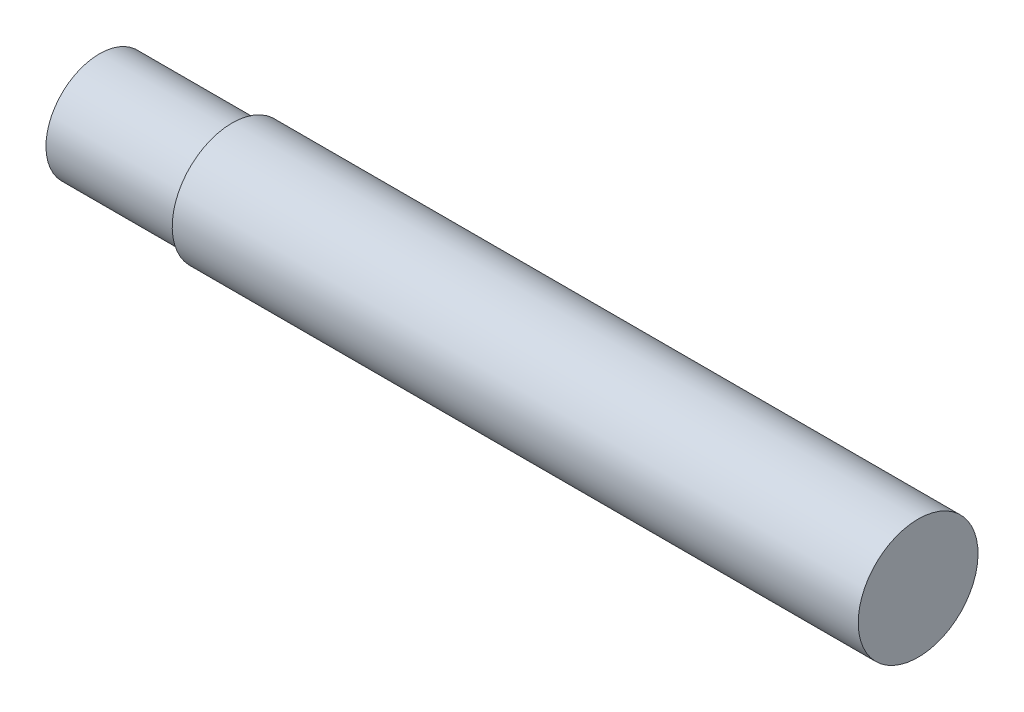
ISO-10303-21;
HEADER;
FILE_DESCRIPTION(('STEP AP214'),'2;1');
FILE_NAME('part.step','',(''),(''),'','','');
FILE_SCHEMA(('AUTOMOTIVE_DESIGN { 1 0 10303 214 1 1 1 1 }'));
ENDSEC;
DATA;
#1=APPLICATION_CONTEXT('core data for automotive mechanical design processes');
#2=APPLICATION_PROTOCOL_DEFINITION('international standard','automotive_design',2000,#1);
#3=PRODUCT_CONTEXT('',#1,'mechanical');
#4=PRODUCT('Part','Part','',(#3));
#5=PRODUCT_RELATED_PRODUCT_CATEGORY('part','',(#4));
#6=PRODUCT_DEFINITION_FORMATION('','',#4);
#7=PRODUCT_DEFINITION_CONTEXT('part definition',#1,'design');
#8=PRODUCT_DEFINITION('design','',#6,#7);
#9=PRODUCT_DEFINITION_SHAPE('','',#8);
#10=(LENGTH_UNIT() NAMED_UNIT(*) SI_UNIT(.MILLI.,.METRE.));
#11=(NAMED_UNIT(*) PLANE_ANGLE_UNIT() SI_UNIT($,.RADIAN.));
#12=(NAMED_UNIT(*) SI_UNIT($,.STERADIAN.) SOLID_ANGLE_UNIT());
#13=UNCERTAINTY_MEASURE_WITH_UNIT(LENGTH_MEASURE(1.E-05),#10,'distance_accuracy_value','');
#14=(GEOMETRIC_REPRESENTATION_CONTEXT(3) GLOBAL_UNCERTAINTY_ASSIGNED_CONTEXT((#13)) GLOBAL_UNIT_ASSIGNED_CONTEXT((#10,
#11,#12)) REPRESENTATION_CONTEXT('',''));
#15=CARTESIAN_POINT('',(0.,0.,0.));
#16=DIRECTION('',(0.,0.,1.));
#17=DIRECTION('',(1.,0.,0.));
#18=AXIS2_PLACEMENT_3D('',#15,#16,#17);
#19=CARTESIAN_POINT('',(-574.,-1.12036208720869E-13,0.));
#20=DIRECTION('',(-1.,0.,0.));
#21=DIRECTION('',(0.,-1.,0.));
#22=AXIS2_PLACEMENT_3D('',#19,#20,#21);
#23=PLANE('',#22);
#24=CARTESIAN_POINT('',(-574.,-1.12036208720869E-13,0.));
#25=DIRECTION('',(1.,0.,0.));
#26=DIRECTION('',(0.,1.,0.));
#27=AXIS2_PLACEMENT_3D('',#24,#25,#26);
#28=CIRCLE('',#27,37.5);
#29=CARTESIAN_POINT('',(-574.,37.4999999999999,0.));
#30=VERTEX_POINT('',#29);
#31=EDGE_CURVE('E10',#30,#30,#28,.T.);
#32=ORIENTED_EDGE('',*,*,#31,.F.);
#33=EDGE_LOOP('',(#32));
#34=FACE_BOUND('',#33,.T.);
#35=ADVANCED_FACE('F30',(#34),#23,.T.);
#36=CARTESIAN_POINT('',(0.,0.,0.));
#37=DIRECTION('',(1.,0.,0.));
#38=DIRECTION('',(0.,1.,0.));
#39=AXIS2_PLACEMENT_3D('',#36,#37,#38);
#40=CYLINDRICAL_SURFACE('',#39,37.5);
#41=ORIENTED_EDGE('',*,*,#31,.T.);
#42=EDGE_LOOP('',(#41));
#43=FACE_BOUND('',#42,.T.);
#44=CARTESIAN_POINT('',(-481.,0.,0.));
#45=DIRECTION('',(1.,0.,0.));
#46=DIRECTION('',(0.,1.,0.));
#47=AXIS2_PLACEMENT_3D('',#44,#45,#46);
#48=CIRCLE('',#47,37.5);
#49=CARTESIAN_POINT('',(-481.,37.4999999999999,0.));
#50=VERTEX_POINT('',#49);
#51=EDGE_CURVE('E36',#50,#50,#48,.T.);
#52=ORIENTED_EDGE('',*,*,#51,.F.);
#53=EDGE_LOOP('',(#52));
#54=FACE_BOUND('',#53,.T.);
#55=ADVANCED_FACE('F62',(#43,#54),#40,.T.);
#56=CARTESIAN_POINT('',(-481.,37.4999999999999,0.));
#57=DIRECTION('',(-1.,0.,0.));
#58=DIRECTION('',(0.,-1.,0.));
#59=AXIS2_PLACEMENT_3D('',#56,#57,#58);
#60=PLANE('',#59);
#61=ORIENTED_EDGE('',*,*,#51,.T.);
#62=EDGE_LOOP('',(#61));
#63=FACE_BOUND('',#62,.T.);
#64=CARTESIAN_POINT('',(-481.,0.,0.));
#65=DIRECTION('',(1.,0.,0.));
#66=DIRECTION('',(0.,1.,0.));
#67=AXIS2_PLACEMENT_3D('',#64,#65,#66);
#68=CIRCLE('',#67,42.0000000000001);
#69=CARTESIAN_POINT('',(-481.,42.,0.));
#70=VERTEX_POINT('',#69);
#71=EDGE_CURVE('E40',#70,#70,#68,.T.);
#72=ORIENTED_EDGE('',*,*,#71,.F.);
#73=EDGE_LOOP('',(#72));
#74=FACE_BOUND('',#73,.T.);
#75=ADVANCED_FACE('F54',(#63,#74),#60,.T.);
#76=CARTESIAN_POINT('',(0.,0.,0.));
#77=DIRECTION('',(1.,0.,0.));
#78=DIRECTION('',(0.,1.,0.));
#79=AXIS2_PLACEMENT_3D('',#76,#77,#78);
#80=CYLINDRICAL_SURFACE('',#79,42.);
#81=ORIENTED_EDGE('',*,*,#71,.T.);
#82=EDGE_LOOP('',(#81));
#83=FACE_BOUND('',#82,.T.);
#84=CARTESIAN_POINT('',(0.,0.,0.));
#85=DIRECTION('',(1.,0.,0.));
#86=DIRECTION('',(0.,1.,0.));
#87=AXIS2_PLACEMENT_3D('',#84,#85,#86);
#88=CIRCLE('',#87,42.);
#89=CARTESIAN_POINT('',(0.,42.,0.));
#90=VERTEX_POINT('',#89);
#91=EDGE_CURVE('E44',#90,#90,#88,.T.);
#92=ORIENTED_EDGE('',*,*,#91,.F.);
#93=EDGE_LOOP('',(#92));
#94=FACE_BOUND('',#93,.T.);
#95=ADVANCED_FACE('F52',(#83,#94),#80,.T.);
#96=CARTESIAN_POINT('',(0.,42.,0.));
#97=DIRECTION('',(1.,0.,0.));
#98=DIRECTION('',(0.,1.,0.));
#99=AXIS2_PLACEMENT_3D('',#96,#97,#98);
#100=PLANE('',#99);
#101=ORIENTED_EDGE('',*,*,#91,.T.);
#102=EDGE_LOOP('',(#101));
#103=FACE_BOUND('',#102,.T.);
#104=ADVANCED_FACE('F50',(#103),#100,.T.);
#105=CLOSED_SHELL('',(#35,#55,#75,#95,#104));
#106=MANIFOLD_SOLID_BREP('B2',#105);
#107=ADVANCED_BREP_SHAPE_REPRESENTATION('',(#18,#106),#14);
#108=SHAPE_DEFINITION_REPRESENTATION(#9,#107);
ENDSEC;
END-ISO-10303-21;
